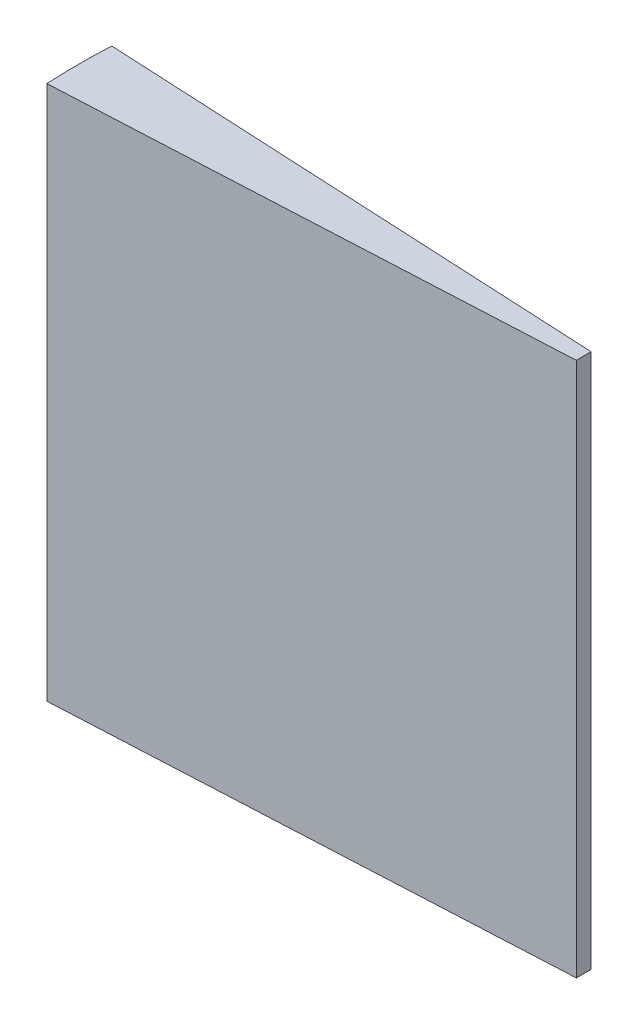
from build123d import *

# Parameters (mm, degrees)
SKETCH1_W      = 107.95
SKETCH1_H      = 114.3
REVOLVE1_ANGLE = 5.7


with BuildPart() as part:
    # Sketch1 → Revolve1 (revolve, symmetric)
    with BuildSketch(Plane.XY) as revolve1_sk:
        with Locations((-85.725, 57.15)):
            Rectangle(SKETCH1_W, SKETCH1_H)
    revolve(axis=Axis((0, 0, 0), (0, 1, 0)), revolution_arc=REVOLVE1_ANGLE / 2)
    revolve(revolve1_sk.sketch, axis=Axis((0, 0, 0), (0, -1, 0)), revolution_arc=REVOLVE1_ANGLE / 2)


solid = part.part
